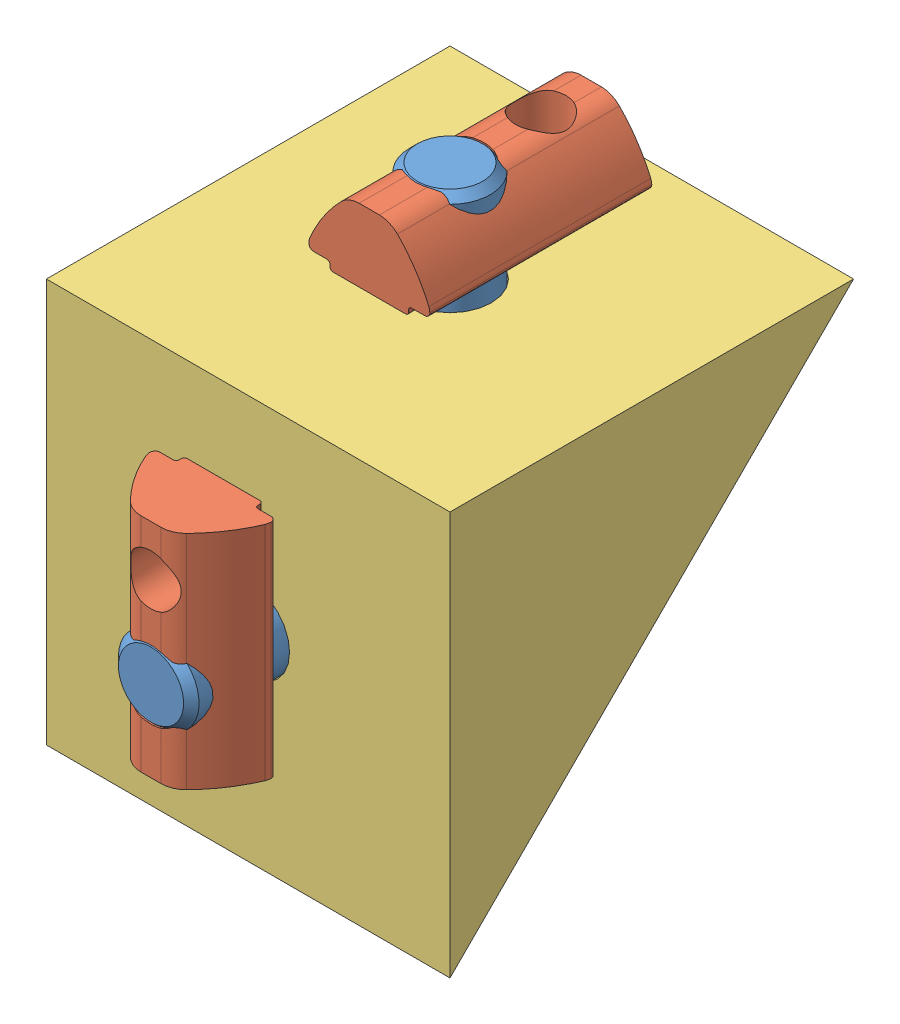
SolidWorks assembly P006956.sldasm, configuration Standard (file format 12000). Lengths in mm.
Overall size (40 50.01 49.64).
5 component instances, 3 part files, 11 mates.
Components (placement in the parent):
- P003249-1: P003249.SLDPRT [Standard] at (0 -20 -4.3631) x (-0.790852 0.612007 0) z (0 0 -1) size (14 14 18.6)
- P005840-1: P005840.sldprt [Default] at (0 -6 2.4369) x (-1 0 0) z (0 -1 0) size (12 7.21 22)
- P005840-2: P005840.sldprt [Default] at (0 2.8 -34) x (-1 0 0) z (0 0 1) size (12 7.21 22)
- P003249-2: P003249.SLDPRT [Standard] at (0 -4 -20) x (0.00574 0 -0.999984) z (0 -1 0) size (14 14 18.6)
- P000484-2: P000484.SLDPRT [Standard] at origin size (40 40 40)
Mates (geometry in assembly coordinates):
- Deckungsgleich803: coordinate: point of P000484-2
- Konzentrisch2470: concentric anti-aligned: cylinder of P003249-2 through (0 2.8166 -20) axis (0 1 0) radius 4; cylinder of P000484-2 through (0 26 -20) axis (0 -1 0) radius 4.1
- Konzentrisch2471: concentric anti-aligned: cylinder of P003249-1 through (0 -20 2.4535) axis (0 0 1) radius 4; cylinder of P000484-2 through (0 -20 25.6369) axis (0 0 -1) radius 4.1
- Deckungsgleich804: coincident anti-aligned: plane of P003249-1 through (4.5079 -23.4884 -4.3631) normal (0 0 1); plane of P000484-2 through (-15 -4 -4.3631) normal (0 0 -1)
- Deckungsgleich805: coincident anti-aligned: plane of P003249-2 through (-0.0327 -4 -14.3001) normal (0 1 0); plane of P000484-2 through (-15 -4 -4.3631) normal (0 -1 0)
- Konzentrisch2472: concentric anti-aligned: cylinder of P005840-2 through (0 14.1171 -20) axis (0 -1 0) radius 3.4; cylinder of P003249-2 through (0 2.8166 -20) axis (0 1 0) radius 4
- Konzentrisch2473: concentric anti-aligned: cylinder of P003249-1 through (0 -20 2.4535) axis (0 0 1) radius 4; cylinder of P005840-1 through (0 -20 15.6369) axis (0 0 -1) radius 3.4
- Parallel1: parallel anti-aligned: line of P005840-1 through (5.9012 -28 17.4239) axis (0 1 0); line of P000484-2 through (20 0 0) axis (0 -1 0)
- Parallel2: parallel: line of P005840-2 through (2.7903 20.5685 -34) axis (0 0 1); plane of P000484-2 through (20 0 0) normal (1 0 0)
- Deckungsgleich806: coincident aligned: plane of P003249-1 through (1.2785 -20.9894 9.6369) normal (0 0 1); plane of P005840-1 through (2 -28 9.6369) normal (0 0 1)
- Deckungsgleich807: coincident aligned: plane of P005840-2 through (2 10 -12) normal (0 1 0); plane of P003249-2 through (-0.0093 10 -18.3834) normal (0 1 0)
